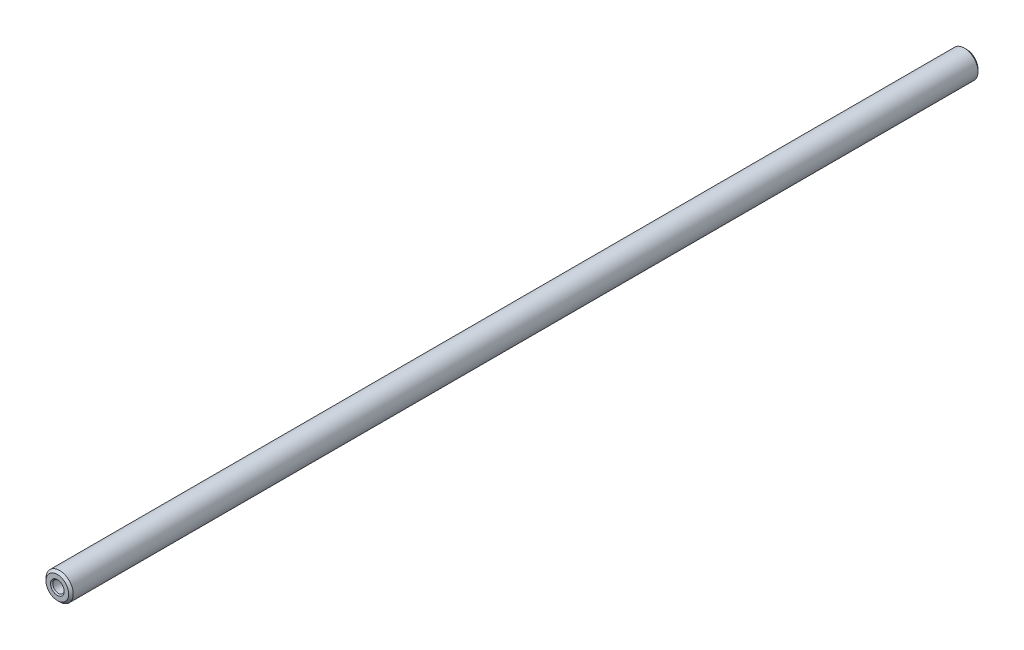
from build123d import *

# Parameters (mm, degrees)
SKETCH1_R                       = 2.995
BOSS_EXTRUDE1_DEPTH             = 200
CHAMFER1_SIZE                   = 0.5
M3X0_5_TAPPED_HOLE1_D           = 2.5
M3X0_5_TAPPED_HOLE1_DEPTH       = 3
M3X0_5_TAPPED_HOLE1_CSINK_D     = 3
M3X0_5_TAPPED_HOLE1_CSINK_ANGLE = 90
M3X0_5_TAPPED_HOLE1_TIP         = 0.751075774
M3X0_5_TAPPED_HOLE2_D           = 2.5
M3X0_5_TAPPED_HOLE2_DEPTH       = 3
M3X0_5_TAPPED_HOLE2_CSINK_D     = 3
M3X0_5_TAPPED_HOLE2_CSINK_ANGLE = 90
M3X0_5_TAPPED_HOLE2_TIP         = 0.751075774


with BuildPart() as part:
    # Sketch1 → Boss-Extrude1 (new body)
    with BuildSketch(Plane.XY):
        Circle(SKETCH1_R)
    extrude(amount=BOSS_EXTRUDE1_DEPTH)

    # Chamfer1
    chamfer1_edges = [part.edges().sort_by_distance(p)[0] for p in [
        (-2.995, 0, 0),
        (-2.995, 0, 200),
    ]]
    chamfer(chamfer1_edges, length=CHAMFER1_SIZE)

    # M3x0.5 Tapped Hole1
    with Locations(Plane(origin=(-0.086424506, -0.023905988, 0), x_dir=(-1, 0, 0), z_dir=(0, 0, -1))):
        with Locations((-0.086424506, 0.023905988)):
            CounterSinkHole(M3X0_5_TAPPED_HOLE1_D / 2, M3X0_5_TAPPED_HOLE1_CSINK_D / 2, depth=M3X0_5_TAPPED_HOLE1_DEPTH, counter_sink_angle=M3X0_5_TAPPED_HOLE1_CSINK_ANGLE)
            with Locations((0, 0, -(M3X0_5_TAPPED_HOLE1_DEPTH + M3X0_5_TAPPED_HOLE1_TIP / 2))):  # 118° drill point
                Cone(0, M3X0_5_TAPPED_HOLE1_D / 2, M3X0_5_TAPPED_HOLE1_TIP, mode=Mode.SUBTRACT)

    # M3x0.5 Tapped Hole2
    with Locations(Plane(origin=(0.027446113, -0.330767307, 200), x_dir=(1, 0, 0), z_dir=(0, 0, 1))):
        with Locations((-0.027446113, 0.330767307)):
            CounterSinkHole(M3X0_5_TAPPED_HOLE2_D / 2, M3X0_5_TAPPED_HOLE2_CSINK_D / 2, depth=M3X0_5_TAPPED_HOLE2_DEPTH, counter_sink_angle=M3X0_5_TAPPED_HOLE2_CSINK_ANGLE)
            with Locations((0, 0, -(M3X0_5_TAPPED_HOLE2_DEPTH + M3X0_5_TAPPED_HOLE2_TIP / 2))):  # 118° drill point
                Cone(0, M3X0_5_TAPPED_HOLE2_D / 2, M3X0_5_TAPPED_HOLE2_TIP, mode=Mode.SUBTRACT)


solid = part.part
